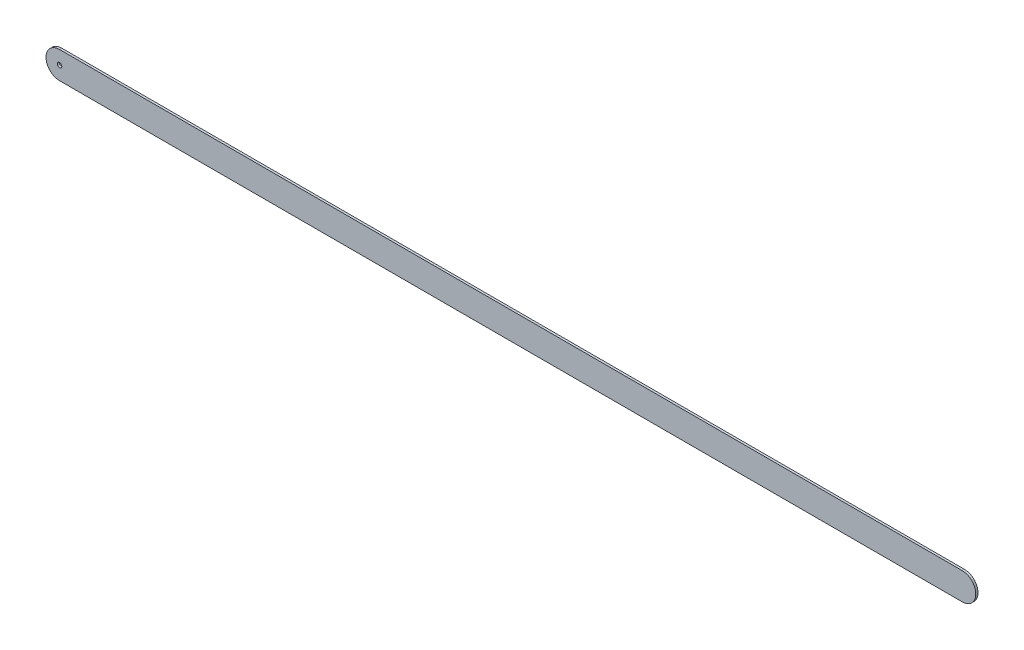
ISO-10303-21;
HEADER;
FILE_DESCRIPTION(('STEP AP214'),'2;1');
FILE_NAME('part.step','',(''),(''),'','','');
FILE_SCHEMA(('AUTOMOTIVE_DESIGN { 1 0 10303 214 1 1 1 1 }'));
ENDSEC;
DATA;
#1=APPLICATION_CONTEXT('core data for automotive mechanical design processes');
#2=APPLICATION_PROTOCOL_DEFINITION('international standard','automotive_design',2000,#1);
#3=PRODUCT_CONTEXT('',#1,'mechanical');
#4=PRODUCT('Part','Part','',(#3));
#5=PRODUCT_RELATED_PRODUCT_CATEGORY('part','',(#4));
#6=PRODUCT_DEFINITION_FORMATION('','',#4);
#7=PRODUCT_DEFINITION_CONTEXT('part definition',#1,'design');
#8=PRODUCT_DEFINITION('design','',#6,#7);
#9=PRODUCT_DEFINITION_SHAPE('','',#8);
#10=(LENGTH_UNIT() NAMED_UNIT(*) SI_UNIT(.MILLI.,.METRE.));
#11=(NAMED_UNIT(*) PLANE_ANGLE_UNIT() SI_UNIT($,.RADIAN.));
#12=(NAMED_UNIT(*) SI_UNIT($,.STERADIAN.) SOLID_ANGLE_UNIT());
#13=UNCERTAINTY_MEASURE_WITH_UNIT(LENGTH_MEASURE(1.E-05),#10,'distance_accuracy_value','');
#14=(GEOMETRIC_REPRESENTATION_CONTEXT(3) GLOBAL_UNCERTAINTY_ASSIGNED_CONTEXT((#13)) GLOBAL_UNIT_ASSIGNED_CONTEXT((#10,
#11,#12)) REPRESENTATION_CONTEXT('',''));
#15=CARTESIAN_POINT('',(0.,0.,0.));
#16=DIRECTION('',(0.,0.,1.));
#17=DIRECTION('',(1.,0.,0.));
#18=AXIS2_PLACEMENT_3D('',#15,#16,#17);
#19=CARTESIAN_POINT('',(0.,0.,1.));
#20=DIRECTION('',(0.,0.,1.));
#21=DIRECTION('',(1.,0.,0.));
#22=AXIS2_PLACEMENT_3D('',#19,#20,#21);
#23=PLANE('',#22);
#24=CARTESIAN_POINT('',(0.,0.,1.));
#25=DIRECTION('',(0.,0.,1.));
#26=DIRECTION('',(1.,0.,0.));
#27=AXIS2_PLACEMENT_3D('',#24,#25,#26);
#28=CIRCLE('',#27,6.);
#29=CARTESIAN_POINT('',(0.,6.,1.));
#30=VERTEX_POINT('',#29);
#31=CARTESIAN_POINT('',(0.,-6.,1.));
#32=VERTEX_POINT('',#31);
#33=EDGE_CURVE('E91',#30,#32,#28,.T.);
#34=ORIENTED_EDGE('',*,*,#33,.T.);
#35=DIRECTION('',(1.,0.,0.));
#36=VECTOR('',#35,1.);
#37=CARTESIAN_POINT('',(0.,-6.,1.));
#38=LINE('',#37,#36);
#39=CARTESIAN_POINT('',(400.,-6.,1.));
#40=VERTEX_POINT('',#39);
#41=EDGE_CURVE('E86',#32,#40,#38,.T.);
#42=ORIENTED_EDGE('',*,*,#41,.T.);
#43=CARTESIAN_POINT('',(400.,0.,1.));
#44=DIRECTION('',(0.,0.,1.));
#45=DIRECTION('',(1.,0.,0.));
#46=AXIS2_PLACEMENT_3D('',#43,#44,#45);
#47=CIRCLE('',#46,6.);
#48=CARTESIAN_POINT('',(400.,6.,1.));
#49=VERTEX_POINT('',#48);
#50=EDGE_CURVE('E89',#40,#49,#47,.T.);
#51=ORIENTED_EDGE('',*,*,#50,.T.);
#52=DIRECTION('',(-1.,0.,0.));
#53=VECTOR('',#52,1.);
#54=CARTESIAN_POINT('',(0.,6.,1.));
#55=LINE('',#54,#53);
#56=EDGE_CURVE('E56',#49,#30,#55,.T.);
#57=ORIENTED_EDGE('',*,*,#56,.T.);
#58=EDGE_LOOP('',(#34,#42,#51,#57));
#59=FACE_BOUND('',#58,.T.);
#60=CARTESIAN_POINT('',(0.,0.,1.));
#61=DIRECTION('',(0.,0.,1.));
#62=DIRECTION('',(1.,0.,0.));
#63=AXIS2_PLACEMENT_3D('',#60,#61,#62);
#64=CIRCLE('',#63,1.);
#65=CARTESIAN_POINT('',(1.,0.,1.));
#66=VERTEX_POINT('',#65);
#67=EDGE_CURVE('E106',#66,#66,#64,.T.);
#68=ORIENTED_EDGE('',*,*,#67,.F.);
#69=EDGE_LOOP('',(#68));
#70=FACE_BOUND('',#69,.T.);
#71=ADVANCED_FACE('F39',(#59,#70),#23,.T.);
#72=CARTESIAN_POINT('',(0.,0.,0.));
#73=DIRECTION('',(0.,0.,1.));
#74=DIRECTION('',(1.,0.,0.));
#75=AXIS2_PLACEMENT_3D('',#72,#73,#74);
#76=PLANE('',#75);
#77=CARTESIAN_POINT('',(0.,0.,0.));
#78=DIRECTION('',(0.,0.,1.));
#79=DIRECTION('',(1.,0.,0.));
#80=AXIS2_PLACEMENT_3D('',#77,#78,#79);
#81=CIRCLE('',#80,6.);
#82=CARTESIAN_POINT('',(0.,6.,0.));
#83=VERTEX_POINT('',#82);
#84=CARTESIAN_POINT('',(0.,-6.,0.));
#85=VERTEX_POINT('',#84);
#86=EDGE_CURVE('E103',#83,#85,#81,.T.);
#87=ORIENTED_EDGE('',*,*,#86,.F.);
#88=DIRECTION('',(-1.,0.,0.));
#89=VECTOR('',#88,1.);
#90=CARTESIAN_POINT('',(0.,6.,0.));
#91=LINE('',#90,#89);
#92=CARTESIAN_POINT('',(400.,6.,0.));
#93=VERTEX_POINT('',#92);
#94=EDGE_CURVE('E79',#93,#83,#91,.T.);
#95=ORIENTED_EDGE('',*,*,#94,.F.);
#96=CARTESIAN_POINT('',(400.,0.,0.));
#97=DIRECTION('',(0.,0.,1.));
#98=DIRECTION('',(1.,0.,0.));
#99=AXIS2_PLACEMENT_3D('',#96,#97,#98);
#100=CIRCLE('',#99,6.);
#101=CARTESIAN_POINT('',(400.,-6.,0.));
#102=VERTEX_POINT('',#101);
#103=EDGE_CURVE('E73',#102,#93,#100,.T.);
#104=ORIENTED_EDGE('',*,*,#103,.F.);
#105=DIRECTION('',(1.,0.,0.));
#106=VECTOR('',#105,1.);
#107=CARTESIAN_POINT('',(0.,-6.,0.));
#108=LINE('',#107,#106);
#109=EDGE_CURVE('E95',#85,#102,#108,.T.);
#110=ORIENTED_EDGE('',*,*,#109,.F.);
#111=EDGE_LOOP('',(#87,#95,#104,#110));
#112=FACE_BOUND('',#111,.T.);
#113=CARTESIAN_POINT('',(0.,0.,0.));
#114=DIRECTION('',(0.,0.,1.));
#115=DIRECTION('',(1.,0.,0.));
#116=AXIS2_PLACEMENT_3D('',#113,#114,#115);
#117=CIRCLE('',#116,1.);
#118=CARTESIAN_POINT('',(1.,0.,0.));
#119=VERTEX_POINT('',#118);
#120=EDGE_CURVE('E118',#119,#119,#117,.T.);
#121=ORIENTED_EDGE('',*,*,#120,.T.);
#122=EDGE_LOOP('',(#121));
#123=FACE_BOUND('',#122,.T.);
#124=ADVANCED_FACE('F114',(#112,#123),#76,.F.);
#125=CARTESIAN_POINT('',(0.,0.,1.));
#126=DIRECTION('',(0.,0.,-1.));
#127=DIRECTION('',(-1.,0.,0.));
#128=AXIS2_PLACEMENT_3D('',#125,#126,#127);
#129=CYLINDRICAL_SURFACE('',#128,6.);
#130=ORIENTED_EDGE('',*,*,#86,.T.);
#131=DIRECTION('',(0.,0.,-1.));
#132=VECTOR('',#131,1.);
#133=CARTESIAN_POINT('',(0.,-6.,1.));
#134=LINE('',#133,#132);
#135=EDGE_CURVE('E11',#32,#85,#134,.T.);
#136=ORIENTED_EDGE('',*,*,#135,.F.);
#137=ORIENTED_EDGE('',*,*,#33,.F.);
#138=DIRECTION('',(0.,0.,-1.));
#139=VECTOR('',#138,1.);
#140=CARTESIAN_POINT('',(0.,6.,1.));
#141=LINE('',#140,#139);
#142=EDGE_CURVE('E99',#30,#83,#141,.T.);
#143=ORIENTED_EDGE('',*,*,#142,.T.);
#144=EDGE_LOOP('',(#130,#136,#137,#143));
#145=FACE_BOUND('',#144,.T.);
#146=ADVANCED_FACE('F41',(#145),#129,.T.);
#147=CARTESIAN_POINT('',(0.,-6.,1.));
#148=DIRECTION('',(0.,1.,0.));
#149=DIRECTION('',(0.,0.,1.));
#150=AXIS2_PLACEMENT_3D('',#147,#148,#149);
#151=PLANE('',#150);
#152=ORIENTED_EDGE('',*,*,#109,.T.);
#153=DIRECTION('',(0.,0.,-1.));
#154=VECTOR('',#153,1.);
#155=CARTESIAN_POINT('',(400.,-6.,1.));
#156=LINE('',#155,#154);
#157=EDGE_CURVE('E48',#40,#102,#156,.T.);
#158=ORIENTED_EDGE('',*,*,#157,.F.);
#159=ORIENTED_EDGE('',*,*,#41,.F.);
#160=ORIENTED_EDGE('',*,*,#135,.T.);
#161=EDGE_LOOP('',(#152,#158,#159,#160));
#162=FACE_BOUND('',#161,.T.);
#163=ADVANCED_FACE('F94',(#162),#151,.F.);
#164=CARTESIAN_POINT('',(400.,0.,1.));
#165=DIRECTION('',(0.,0.,-1.));
#166=DIRECTION('',(-1.,0.,0.));
#167=AXIS2_PLACEMENT_3D('',#164,#165,#166);
#168=CYLINDRICAL_SURFACE('',#167,6.);
#169=ORIENTED_EDGE('',*,*,#103,.T.);
#170=DIRECTION('',(0.,0.,-1.));
#171=VECTOR('',#170,1.);
#172=CARTESIAN_POINT('',(400.,6.,1.));
#173=LINE('',#172,#171);
#174=EDGE_CURVE('E96',#49,#93,#173,.T.);
#175=ORIENTED_EDGE('',*,*,#174,.F.);
#176=ORIENTED_EDGE('',*,*,#50,.F.);
#177=ORIENTED_EDGE('',*,*,#157,.T.);
#178=EDGE_LOOP('',(#169,#175,#176,#177));
#179=FACE_BOUND('',#178,.T.);
#180=ADVANCED_FACE('F97',(#179),#168,.T.);
#181=CARTESIAN_POINT('',(0.,6.,1.));
#182=DIRECTION('',(0.,-1.,0.));
#183=DIRECTION('',(0.,0.,-1.));
#184=AXIS2_PLACEMENT_3D('',#181,#182,#183);
#185=PLANE('',#184);
#186=ORIENTED_EDGE('',*,*,#94,.T.);
#187=ORIENTED_EDGE('',*,*,#142,.F.);
#188=ORIENTED_EDGE('',*,*,#56,.F.);
#189=ORIENTED_EDGE('',*,*,#174,.T.);
#190=EDGE_LOOP('',(#186,#187,#188,#189));
#191=FACE_BOUND('',#190,.T.);
#192=ADVANCED_FACE('F111',(#191),#185,.F.);
#193=CARTESIAN_POINT('',(0.,0.,1.));
#194=DIRECTION('',(0.,0.,-1.));
#195=DIRECTION('',(-1.,0.,0.));
#196=AXIS2_PLACEMENT_3D('',#193,#194,#195);
#197=CYLINDRICAL_SURFACE('',#196,1.);
#198=ORIENTED_EDGE('',*,*,#67,.T.);
#199=EDGE_LOOP('',(#198));
#200=FACE_BOUND('',#199,.T.);
#201=ORIENTED_EDGE('',*,*,#120,.F.);
#202=EDGE_LOOP('',(#201));
#203=FACE_BOUND('',#202,.T.);
#204=ADVANCED_FACE('F124',(#200,#203),#197,.F.);
#205=CLOSED_SHELL('',(#71,#124,#146,#163,#180,#192,#204));
#206=MANIFOLD_SOLID_BREP('B2',#205);
#207=ADVANCED_BREP_SHAPE_REPRESENTATION('',(#18,#206),#14);
#208=SHAPE_DEFINITION_REPRESENTATION(#9,#207);
ENDSEC;
END-ISO-10303-21;
